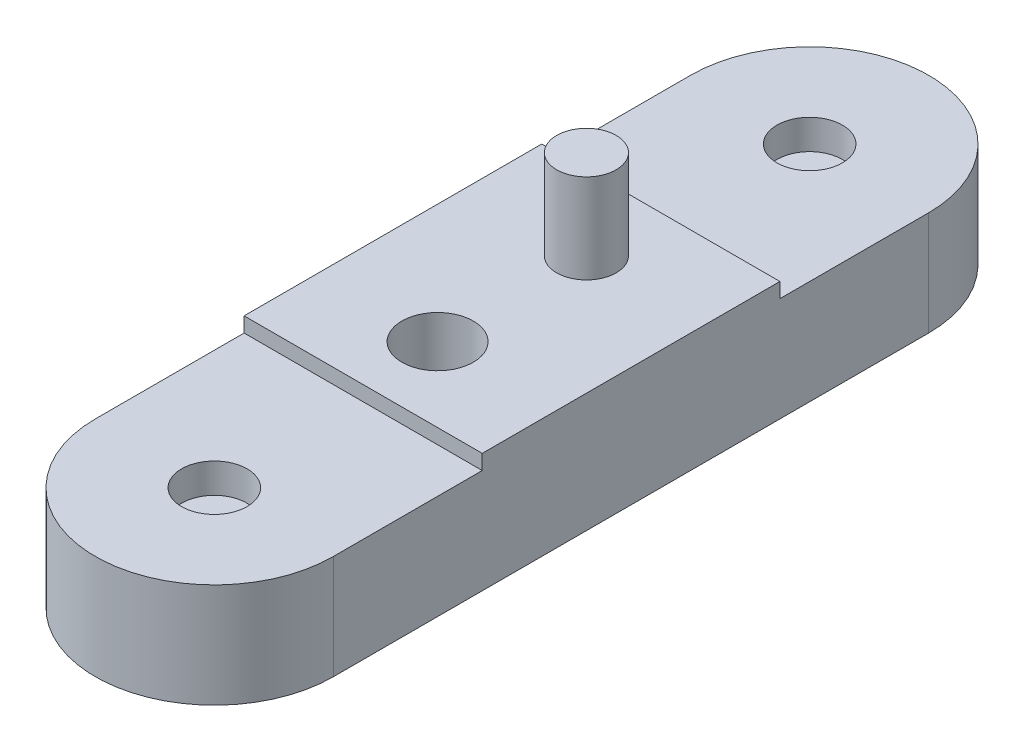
from build123d import *

# Parameters (mm, degrees)
BOSS_EXTRUDE1_DEPTH = 4
CUT_EXTRUDE1_START  = -0.5
CUT_EXTRUDE1_DEPTH  = 0.5
SKETCH3_R           = 1.1
CUT_EXTRUDE2_DEPTH  = 1
SKETCH4_R           = 1
BOSS_EXTRUDE2_DEPTH = 3
SKETCH5_R           = 1.2
CUT_EXTRUDE3_DEPTH  = 4


with BuildPart() as part:
    # Sketch1 → Boss-Extrude1 (new body)
    with BuildSketch(Plane(origin=(0, 0, 0), x_dir=(1, 0, 0), z_dir=(0, 1, 0))):
        with BuildLine():
            Line((-4, -10), (4, -10))
            Line((4, -10), (4, 0))
            ThreePointArc((4, 0), (0, 4), (-4, 0))
            Line((-4, 0), (-4, -10))
        make_face()
    extrude(amount=BOSS_EXTRUDE1_DEPTH)

    # Sketch2 → Cut-Extrude1 (cut)
    with BuildSketch(Plane(origin=(0, 4, 0), x_dir=(1, 0, 0), z_dir=(0, 1, 0)).offset(CUT_EXTRUDE1_START)):
        with BuildLine():
            Line((-4, -5), (4, -5))
            Line((4, -5), (4, 0))
            ThreePointArc((4, 0), (0, 4), (-4, 0))
            Line((-4, 0), (-4, -5))
        make_face()
    extrude(amount=CUT_EXTRUDE1_DEPTH, mode=Mode.SUBTRACT)

    # Sketch3 → Cut-Extrude2 (cut)
    with BuildSketch(Plane(origin=(0, 3.5, 0), x_dir=(1, 0, 0), z_dir=(0, 1, 0))):
        with Locations(Location((0, 0, 0), (0, 0, 270))):
            Circle(SKETCH3_R)
    extrude(amount=-CUT_EXTRUDE2_DEPTH, mode=Mode.SUBTRACT)

    # Mirror1: part across plane


with BuildPart() as part_1:
    add(part.part)
    add(part.part.mirror(Plane(origin=(-4, 4, 10), x_dir=(1, 0, 0), z_dir=(0, 0, -1))))

    # Sketch4 → Boss-Extrude2 (add)
    with BuildSketch(Plane(origin=(0, 4, 0), x_dir=(1, 0, 0), z_dir=(0, 1, 0))):
        with Locations(Location((0, -7.5, 0), (0, 0, 270))):
            Circle(SKETCH4_R)
    extrude(amount=BOSS_EXTRUDE2_DEPTH)

    # Sketch5 → Cut-Extrude3 (cut)
    with BuildSketch(Plane(origin=(0, 4, 0), x_dir=(1, 0, 0), z_dir=(0, 1, 0))):
        with Locations(Location((0, -12.5, 0), (0, 0, 270))):
            Circle(SKETCH5_R)
    extrude(amount=-CUT_EXTRUDE3_DEPTH, mode=Mode.SUBTRACT)


solid = part_1.part
